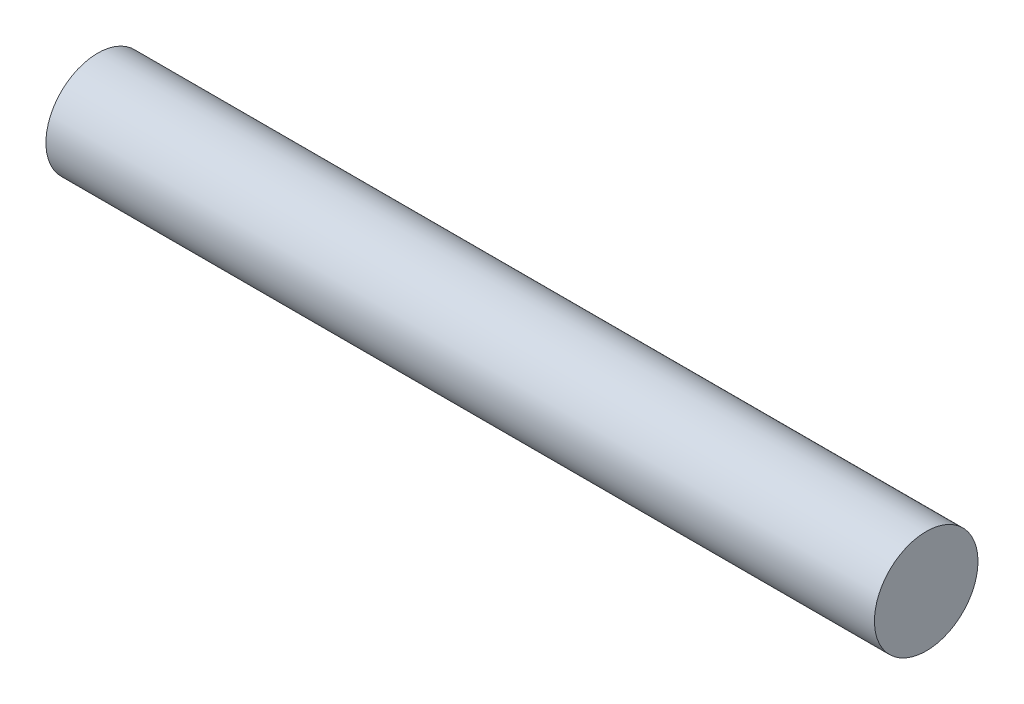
from build123d import *

# Parameters (mm, degrees)
SKETCH1_R           = 1.5875
BOSS_EXTRUDE1_DEPTH = 25.4


with BuildPart() as part:
    # Sketch1 → Boss-Extrude1 (new body)
    with BuildSketch(Plane.YZ):
        with Locations(Location((0, 0, 0), (0, 0, 270))):
            Circle(SKETCH1_R)
    extrude(amount=BOSS_EXTRUDE1_DEPTH)


solid = part.part
